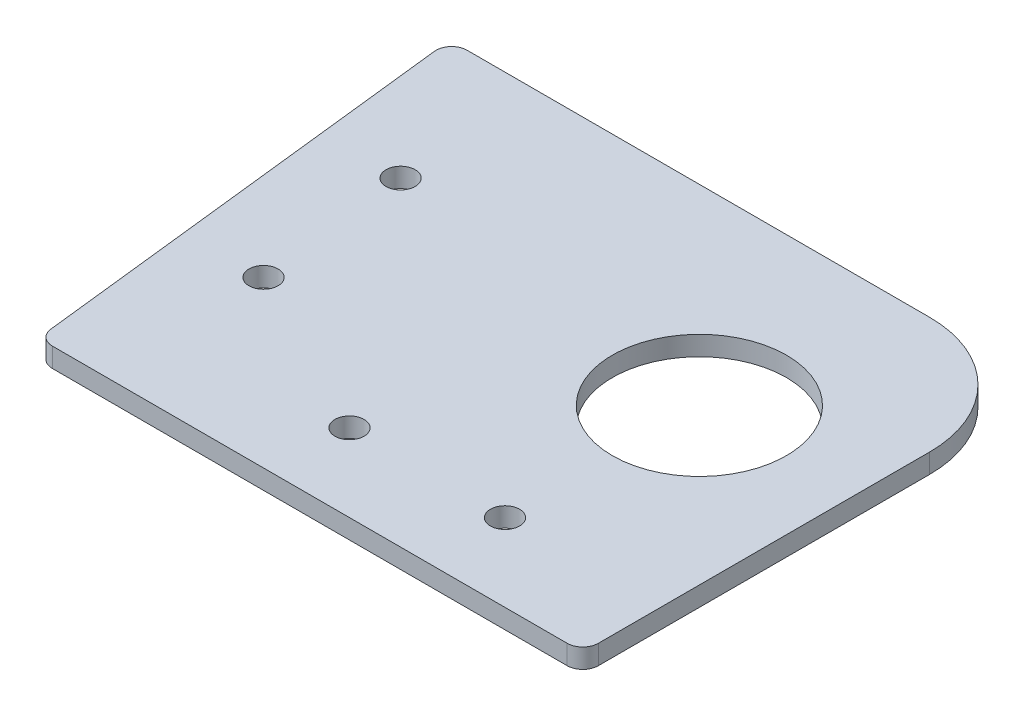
from build123d import *

# Parameters (mm, degrees)
SKETCH1_R           = 14.224
BOSS_EXTRUDE1_DEPTH = 3.175
FILLET1_R           = 2.54
FILLET2_R           = 19.05
SKETCH2_R           = 2.38125
CUT_EXTRUDE1_DEPTH  = 3.175
SKETCH3_R           = 2.38125
CUT_EXTRUDE2_DEPTH  = 3.175


with BuildPart() as part:
    # Sketch1 → Boss-Extrude1 (new body)
    with BuildSketch(Plane(origin=(0, 0, 0), x_dir=(1, 0, 0), z_dir=(0, 1, 0))):
        Polygon((0, 0), (8.546796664, -75.719167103), (97.446796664, -75.719167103), (97.446796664, 0), align=None)
        with Locations(Location((72.046796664, -31.269167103, 0), (0, 0, 270))):
            Circle(SKETCH1_R, mode=Mode.SUBTRACT)
    extrude(amount=BOSS_EXTRUDE1_DEPTH)

    # Fillet1
    fillet1_edges = [part.edges().sort_by_distance(p)[0] for p in [
        (97.446796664, 1.5875, 75.719167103),
        (8.546796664, 1.5875, 75.719167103),
        (0, 1.5875, 0),
    ]]
    fillet(fillet1_edges, radius=FILLET1_R)

    # Fillet2
    fillet2_edges = [part.edges().sort_by_distance(p)[0] for p in [
        (97.446796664, 1.5875, 0),
    ]]
    fillet(fillet2_edges, radius=FILLET2_R)

    # Sketch2 → Cut-Extrude1 (cut)
    with BuildSketch(Plane(origin=(0, 3.175, 0), x_dir=(1, 0, 0), z_dir=(0, 1, 0))):
        with Locations(Location((46.646796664, -63.019167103, 0), (0, 0, 270))):
            Circle(SKETCH2_R)
        with Locations(Location((72.046796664, -63.019167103, 0), (0, 0, 270))):
            Circle(SKETCH2_R)
    extrude(amount=-CUT_EXTRUDE1_DEPTH, mode=Mode.SUBTRACT)

    # Sketch3 → Cut-Extrude2 (cut)
    with BuildSketch(Plane(origin=(0, 3.175, 0), x_dir=(1, 0, 0), z_dir=(0, 1, 0))):
        with Locations(Location((18.339141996, -48.758670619, 0), (0, 0, 270))):
            Circle(SKETCH3_R)
        with Locations(Location((15.489504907, -23.519027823, 0), (0, 0, 270))):
            Circle(SKETCH3_R)
    extrude(amount=-CUT_EXTRUDE2_DEPTH, mode=Mode.SUBTRACT)


solid = part.part
